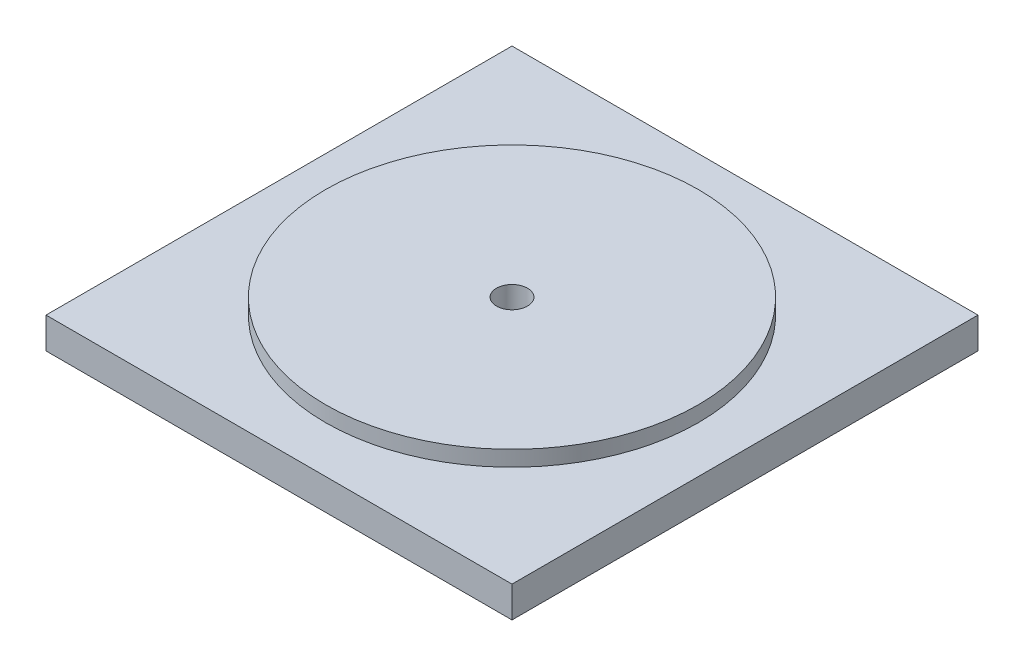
ISO-10303-21;
HEADER;
FILE_DESCRIPTION(('STEP AP214'),'2;1');
FILE_NAME('part.step','',(''),(''),'','','');
FILE_SCHEMA(('AUTOMOTIVE_DESIGN { 1 0 10303 214 1 1 1 1 }'));
ENDSEC;
DATA;
#1=APPLICATION_CONTEXT('core data for automotive mechanical design processes');
#2=APPLICATION_PROTOCOL_DEFINITION('international standard','automotive_design',2000,#1);
#3=PRODUCT_CONTEXT('',#1,'mechanical');
#4=PRODUCT('Part','Part','',(#3));
#5=PRODUCT_RELATED_PRODUCT_CATEGORY('part','',(#4));
#6=PRODUCT_DEFINITION_FORMATION('','',#4);
#7=PRODUCT_DEFINITION_CONTEXT('part definition',#1,'design');
#8=PRODUCT_DEFINITION('design','',#6,#7);
#9=PRODUCT_DEFINITION_SHAPE('','',#8);
#10=(LENGTH_UNIT() NAMED_UNIT(*) SI_UNIT(.MILLI.,.METRE.));
#11=(NAMED_UNIT(*) PLANE_ANGLE_UNIT() SI_UNIT($,.RADIAN.));
#12=(NAMED_UNIT(*) SI_UNIT($,.STERADIAN.) SOLID_ANGLE_UNIT());
#13=UNCERTAINTY_MEASURE_WITH_UNIT(LENGTH_MEASURE(1.E-05),#10,'distance_accuracy_value','');
#14=(GEOMETRIC_REPRESENTATION_CONTEXT(3) GLOBAL_UNCERTAINTY_ASSIGNED_CONTEXT((#13)) GLOBAL_UNIT_ASSIGNED_CONTEXT((#10,
#11,#12)) REPRESENTATION_CONTEXT('',''));
#15=CARTESIAN_POINT('',(0.,0.,0.));
#16=DIRECTION('',(0.,0.,1.));
#17=DIRECTION('',(1.,0.,0.));
#18=AXIS2_PLACEMENT_3D('',#15,#16,#17);
#19=CARTESIAN_POINT('',(75.,-10.,-75.));
#20=DIRECTION('',(1.,0.,0.));
#21=DIRECTION('',(0.,0.,-1.));
#22=AXIS2_PLACEMENT_3D('',#19,#20,#21);
#23=PLANE('',#22);
#24=DIRECTION('',(0.,0.,-1.));
#25=VECTOR('',#24,1.);
#26=CARTESIAN_POINT('',(75.,0.,-75.));
#27=LINE('',#26,#25);
#28=CARTESIAN_POINT('',(75.0000000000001,0.,75.));
#29=VERTEX_POINT('',#28);
#30=CARTESIAN_POINT('',(75.,0.,-75.));
#31=VERTEX_POINT('',#30);
#32=EDGE_CURVE('E111',#29,#31,#27,.T.);
#33=ORIENTED_EDGE('',*,*,#32,.F.);
#34=DIRECTION('',(0.,1.,0.));
#35=VECTOR('',#34,1.);
#36=CARTESIAN_POINT('',(75.0000000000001,-10.,75.));
#37=LINE('',#36,#35);
#38=CARTESIAN_POINT('',(75.0000000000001,-10.,75.));
#39=VERTEX_POINT('',#38);
#40=EDGE_CURVE('E49',#39,#29,#37,.T.);
#41=ORIENTED_EDGE('',*,*,#40,.F.);
#42=DIRECTION('',(0.,0.,-1.));
#43=VECTOR('',#42,1.);
#44=CARTESIAN_POINT('',(75.,-10.,-75.));
#45=LINE('',#44,#43);
#46=CARTESIAN_POINT('',(75.,-10.,-75.));
#47=VERTEX_POINT('',#46);
#48=EDGE_CURVE('E103',#39,#47,#45,.T.);
#49=ORIENTED_EDGE('',*,*,#48,.T.);
#50=DIRECTION('',(0.,1.,0.));
#51=VECTOR('',#50,1.);
#52=CARTESIAN_POINT('',(75.,-10.,-75.));
#53=LINE('',#52,#51);
#54=EDGE_CURVE('E42',#47,#31,#53,.T.);
#55=ORIENTED_EDGE('',*,*,#54,.T.);
#56=EDGE_LOOP('',(#33,#41,#49,#55));
#57=FACE_BOUND('',#56,.T.);
#58=ADVANCED_FACE('F39',(#57),#23,.T.);
#59=CARTESIAN_POINT('',(-74.9999999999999,-10.,75.));
#60=DIRECTION('',(0.,0.,1.));
#61=DIRECTION('',(1.,0.,0.));
#62=AXIS2_PLACEMENT_3D('',#59,#60,#61);
#63=PLANE('',#62);
#64=DIRECTION('',(1.,0.,0.));
#65=VECTOR('',#64,1.);
#66=CARTESIAN_POINT('',(-74.9999999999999,0.,75.));
#67=LINE('',#66,#65);
#68=CARTESIAN_POINT('',(-74.9999999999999,0.,75.));
#69=VERTEX_POINT('',#68);
#70=EDGE_CURVE('E106',#69,#29,#67,.T.);
#71=ORIENTED_EDGE('',*,*,#70,.F.);
#72=DIRECTION('',(0.,1.,0.));
#73=VECTOR('',#72,1.);
#74=CARTESIAN_POINT('',(-74.9999999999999,-10.,75.));
#75=LINE('',#74,#73);
#76=CARTESIAN_POINT('',(-74.9999999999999,-10.,75.));
#77=VERTEX_POINT('',#76);
#78=EDGE_CURVE('E74',#77,#69,#75,.T.);
#79=ORIENTED_EDGE('',*,*,#78,.F.);
#80=DIRECTION('',(1.,0.,0.));
#81=VECTOR('',#80,1.);
#82=CARTESIAN_POINT('',(-74.9999999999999,-10.,75.));
#83=LINE('',#82,#81);
#84=EDGE_CURVE('E98',#77,#39,#83,.T.);
#85=ORIENTED_EDGE('',*,*,#84,.T.);
#86=ORIENTED_EDGE('',*,*,#40,.T.);
#87=EDGE_LOOP('',(#71,#79,#85,#86));
#88=FACE_BOUND('',#87,.T.);
#89=ADVANCED_FACE('F130',(#88),#63,.T.);
#90=CARTESIAN_POINT('',(-75.,-10.,-75.));
#91=DIRECTION('',(-1.,0.,0.));
#92=DIRECTION('',(0.,0.,1.));
#93=AXIS2_PLACEMENT_3D('',#90,#91,#92);
#94=PLANE('',#93);
#95=DIRECTION('',(0.,0.,1.));
#96=VECTOR('',#95,1.);
#97=CARTESIAN_POINT('',(-75.,0.,-75.));
#98=LINE('',#97,#96);
#99=CARTESIAN_POINT('',(-75.,0.,-75.));
#100=VERTEX_POINT('',#99);
#101=EDGE_CURVE('E92',#100,#69,#98,.T.);
#102=ORIENTED_EDGE('',*,*,#101,.F.);
#103=DIRECTION('',(0.,1.,0.));
#104=VECTOR('',#103,1.);
#105=CARTESIAN_POINT('',(-75.,-10.,-75.));
#106=LINE('',#105,#104);
#107=CARTESIAN_POINT('',(-75.,-10.,-75.));
#108=VERTEX_POINT('',#107);
#109=EDGE_CURVE('E87',#108,#100,#106,.T.);
#110=ORIENTED_EDGE('',*,*,#109,.F.);
#111=DIRECTION('',(0.,0.,1.));
#112=VECTOR('',#111,1.);
#113=CARTESIAN_POINT('',(-75.,-10.,-75.));
#114=LINE('',#113,#112);
#115=EDGE_CURVE('E90',#108,#77,#114,.T.);
#116=ORIENTED_EDGE('',*,*,#115,.T.);
#117=ORIENTED_EDGE('',*,*,#78,.T.);
#118=EDGE_LOOP('',(#102,#110,#116,#117));
#119=FACE_BOUND('',#118,.T.);
#120=ADVANCED_FACE('F89',(#119),#94,.T.);
#121=CARTESIAN_POINT('',(-75.,-10.,-75.));
#122=DIRECTION('',(0.,0.,-1.));
#123=DIRECTION('',(-1.,0.,0.));
#124=AXIS2_PLACEMENT_3D('',#121,#122,#123);
#125=PLANE('',#124);
#126=DIRECTION('',(-1.,0.,0.));
#127=VECTOR('',#126,1.);
#128=CARTESIAN_POINT('',(-75.,0.,-75.));
#129=LINE('',#128,#127);
#130=EDGE_CURVE('E115',#31,#100,#129,.T.);
#131=ORIENTED_EDGE('',*,*,#130,.F.);
#132=ORIENTED_EDGE('',*,*,#54,.F.);
#133=DIRECTION('',(-1.,0.,0.));
#134=VECTOR('',#133,1.);
#135=CARTESIAN_POINT('',(-75.,-10.,-75.));
#136=LINE('',#135,#134);
#137=EDGE_CURVE('E97',#47,#108,#136,.T.);
#138=ORIENTED_EDGE('',*,*,#137,.T.);
#139=ORIENTED_EDGE('',*,*,#109,.T.);
#140=EDGE_LOOP('',(#131,#132,#138,#139));
#141=FACE_BOUND('',#140,.T.);
#142=ADVANCED_FACE('F101',(#141),#125,.T.);
#143=CARTESIAN_POINT('',(0.,-10.,0.));
#144=DIRECTION('',(0.,1.,0.));
#145=DIRECTION('',(0.,0.,1.));
#146=AXIS2_PLACEMENT_3D('',#143,#144,#145);
#147=PLANE('',#146);
#148=CARTESIAN_POINT('',(0.,-10.,0.));
#149=DIRECTION('',(0.,1.,0.));
#150=DIRECTION('',(0.,0.,1.));
#151=AXIS2_PLACEMENT_3D('',#148,#149,#150);
#152=CIRCLE('',#151,5.);
#153=CARTESIAN_POINT('',(0.,-10.,5.));
#154=VERTEX_POINT('',#153);
#155=EDGE_CURVE('E166',#154,#154,#152,.T.);
#156=ORIENTED_EDGE('',*,*,#155,.T.);
#157=EDGE_LOOP('',(#156));
#158=FACE_BOUND('',#157,.T.);
#159=ORIENTED_EDGE('',*,*,#48,.F.);
#160=ORIENTED_EDGE('',*,*,#84,.F.);
#161=ORIENTED_EDGE('',*,*,#115,.F.);
#162=ORIENTED_EDGE('',*,*,#137,.F.);
#163=EDGE_LOOP('',(#159,#160,#161,#162));
#164=FACE_BOUND('',#163,.T.);
#165=ADVANCED_FACE('F96',(#158,#164),#147,.F.);
#166=CARTESIAN_POINT('',(0.,0.,0.));
#167=DIRECTION('',(0.,1.,0.));
#168=DIRECTION('',(0.,0.,1.));
#169=AXIS2_PLACEMENT_3D('',#166,#167,#168);
#170=PLANE('',#169);
#171=CARTESIAN_POINT('',(0.,0.,0.));
#172=DIRECTION('',(0.,1.,0.));
#173=DIRECTION('',(0.,0.,1.));
#174=AXIS2_PLACEMENT_3D('',#171,#172,#173);
#175=CIRCLE('',#174,60.);
#176=CARTESIAN_POINT('',(0.,0.,60.));
#177=VERTEX_POINT('',#176);
#178=EDGE_CURVE('E11',#177,#177,#175,.T.);
#179=ORIENTED_EDGE('',*,*,#178,.F.);
#180=EDGE_LOOP('',(#179));
#181=FACE_BOUND('',#180,.T.);
#182=ORIENTED_EDGE('',*,*,#32,.T.);
#183=ORIENTED_EDGE('',*,*,#130,.T.);
#184=ORIENTED_EDGE('',*,*,#101,.T.);
#185=ORIENTED_EDGE('',*,*,#70,.T.);
#186=EDGE_LOOP('',(#182,#183,#184,#185));
#187=FACE_BOUND('',#186,.T.);
#188=ADVANCED_FACE('F129',(#181,#187),#170,.T.);
#189=CARTESIAN_POINT('',(0.,5.,0.));
#190=DIRECTION('',(0.,-1.,0.));
#191=DIRECTION('',(0.,0.,-1.));
#192=AXIS2_PLACEMENT_3D('',#189,#190,#191);
#193=CYLINDRICAL_SURFACE('',#192,60.);
#194=CARTESIAN_POINT('',(0.,5.,0.));
#195=DIRECTION('',(0.,1.,0.));
#196=DIRECTION('',(0.,0.,1.));
#197=AXIS2_PLACEMENT_3D('',#194,#195,#196);
#198=CIRCLE('',#197,60.);
#199=CARTESIAN_POINT('',(0.,5.,60.));
#200=VERTEX_POINT('',#199);
#201=EDGE_CURVE('E116',#200,#200,#198,.T.);
#202=ORIENTED_EDGE('',*,*,#201,.F.);
#203=EDGE_LOOP('',(#202));
#204=FACE_BOUND('',#203,.T.);
#205=ORIENTED_EDGE('',*,*,#178,.T.);
#206=EDGE_LOOP('',(#205));
#207=FACE_BOUND('',#206,.T.);
#208=ADVANCED_FACE('F148',(#204,#207),#193,.T.);
#209=CARTESIAN_POINT('',(0.,5.,0.));
#210=DIRECTION('',(0.,1.,0.));
#211=DIRECTION('',(0.,0.,1.));
#212=AXIS2_PLACEMENT_3D('',#209,#210,#211);
#213=PLANE('',#212);
#214=CARTESIAN_POINT('',(0.,5.,0.));
#215=DIRECTION('',(0.,1.,0.));
#216=DIRECTION('',(0.,0.,1.));
#217=AXIS2_PLACEMENT_3D('',#214,#215,#216);
#218=CIRCLE('',#217,5.);
#219=CARTESIAN_POINT('',(0.,5.,5.));
#220=VERTEX_POINT('',#219);
#221=EDGE_CURVE('E169',#220,#220,#218,.T.);
#222=ORIENTED_EDGE('',*,*,#221,.F.);
#223=EDGE_LOOP('',(#222));
#224=FACE_BOUND('',#223,.T.);
#225=ORIENTED_EDGE('',*,*,#201,.T.);
#226=EDGE_LOOP('',(#225));
#227=FACE_BOUND('',#226,.T.);
#228=ADVANCED_FACE('F154',(#224,#227),#213,.T.);
#229=CARTESIAN_POINT('',(0.,-10.,0.));
#230=DIRECTION('',(0.,1.,0.));
#231=DIRECTION('',(0.,0.,1.));
#232=AXIS2_PLACEMENT_3D('',#229,#230,#231);
#233=CYLINDRICAL_SURFACE('',#232,5.);
#234=ORIENTED_EDGE('',*,*,#155,.F.);
#235=EDGE_LOOP('',(#234));
#236=FACE_BOUND('',#235,.T.);
#237=ORIENTED_EDGE('',*,*,#221,.T.);
#238=EDGE_LOOP('',(#237));
#239=FACE_BOUND('',#238,.T.);
#240=ADVANCED_FACE('F158',(#236,#239),#233,.F.);
#241=CLOSED_SHELL('',(#58,#89,#120,#142,#165,#188,#208,#228,#240));
#242=MANIFOLD_SOLID_BREP('B2',#241);
#243=ADVANCED_BREP_SHAPE_REPRESENTATION('',(#18,#242),#14);
#244=SHAPE_DEFINITION_REPRESENTATION(#9,#243);
ENDSEC;
END-ISO-10303-21;
